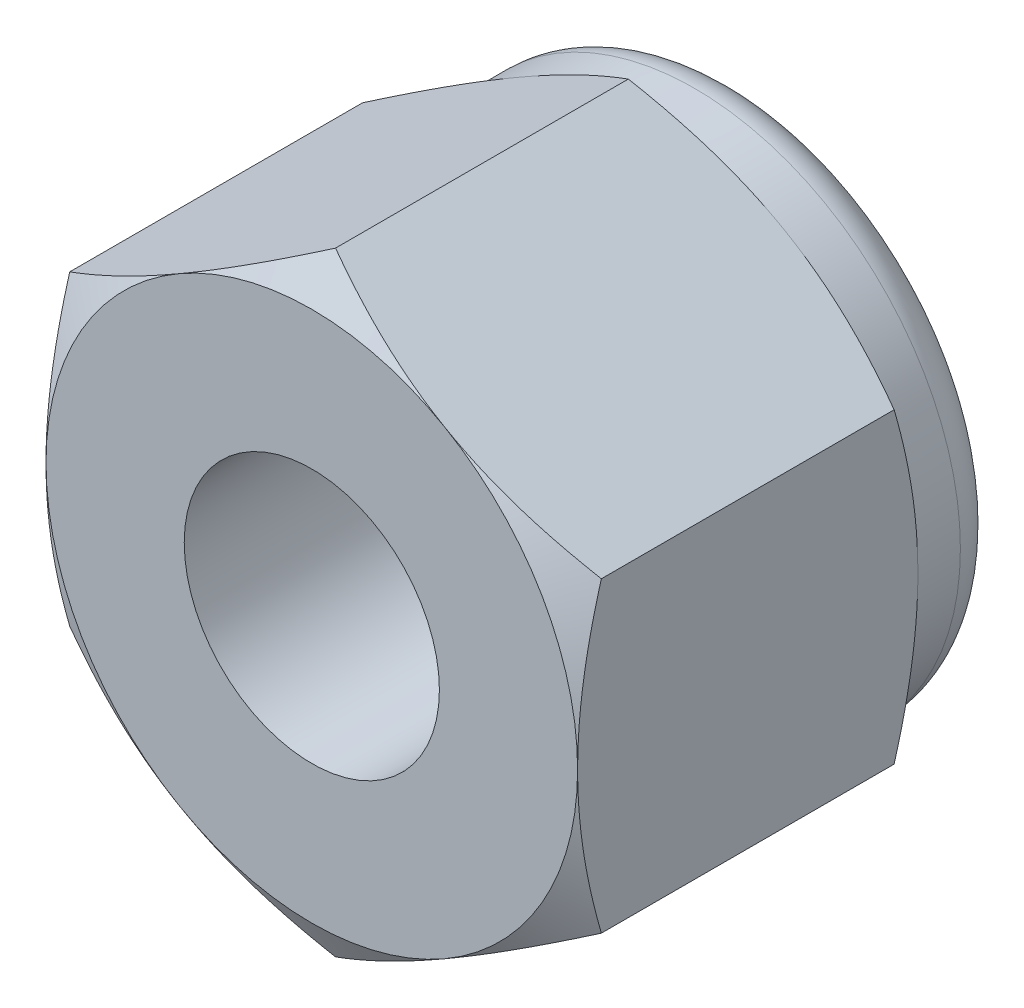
from build123d import *

# Parameters (mm, degrees)
BASE_EXTRUSION_DEPTH    = 6.4
ESQUISSE3_R             = 3
ENL_V_MAT_EXTRU_1_DEPTH = 10.964604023
ESQUISSE5_R             = 3
ESQUISSE5_R_2           = 2.4
BOSS_EXTRU_1_DEPTH      = 6.4


with BuildPart() as part:
    # Esquisse1 → Base-Extrusion (new body)
    with BuildSketch(Plane.XY):
        Polygon((5, -2.886751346), (5, 2.886751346), (0, 5.773502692), (-5, 2.886751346), (-5, -2.886751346), (0, -5.773502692), align=None)
    extrude(amount=-BASE_EXTRUSION_DEPTH)

    # Esquisse2 → Enl_vement de mati_re-R_volution1 (revolve, cut)
    with BuildSketch(Plane(origin=(0, 0, 0), x_dir=(1, 0, 0), z_dir=(0, 1, 0))):
        Polygon((-5, 0), (-11.542562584, 0), (-11.542562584, 6.4), (-5, 6.4), (-10.542562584, 3.2), align=None)
    revolve(axis=Axis((0, 0, -6.4), (0, 0, 1)), mode=Mode.SUBTRACT)

    # Esquisse3 → Enl_v. mat.-Extru.1 (cut, through all)
    with BuildSketch(Plane.XY):
        Circle(ESQUISSE3_R)
    extrude(amount=-ENL_V_MAT_EXTRU_1_DEPTH, mode=Mode.SUBTRACT)

    # Esquisse4 → Boss.-R_vol.1 (revolve)
    with BuildSketch(Plane(origin=(0, 0, 0), x_dir=(0, 0, -1), z_dir=(1, 0, 0)), mode=Mode.PRIVATE) as boss_r_vol_1_sk:
        with BuildLine():
            Line((6.4, 5), (7.2, 5))
            ThreePointArc((7.2, 5), (7.765685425, 4.765685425), (8, 4.2))
            Line((8, 4.2), (8, 3.943375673))
            Line((8, 3.943375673), (7.333333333, 3.943375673))
            Line((7.333333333, 3.943375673), (7.333333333, 2.886751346))
            Line((7.333333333, 2.886751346), (6.4, 2.886751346))
            Line((6.4, 2.886751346), (6.4, 5))
        make_face()
    revolve(boss_r_vol_1_sk.sketch.rotate(Axis((0, 0, 0), (0, 0, -1)), 90), axis=Axis((0, 0, 0), (0, 0, -1)))

    # Esquisse5 → Boss.-Extru.1 (add)
    with BuildSketch(Plane.XY):
        Circle(ESQUISSE5_R)
        Circle(ESQUISSE5_R_2, mode=Mode.SUBTRACT)
    extrude(amount=-BOSS_EXTRU_1_DEPTH)


solid = part.part
